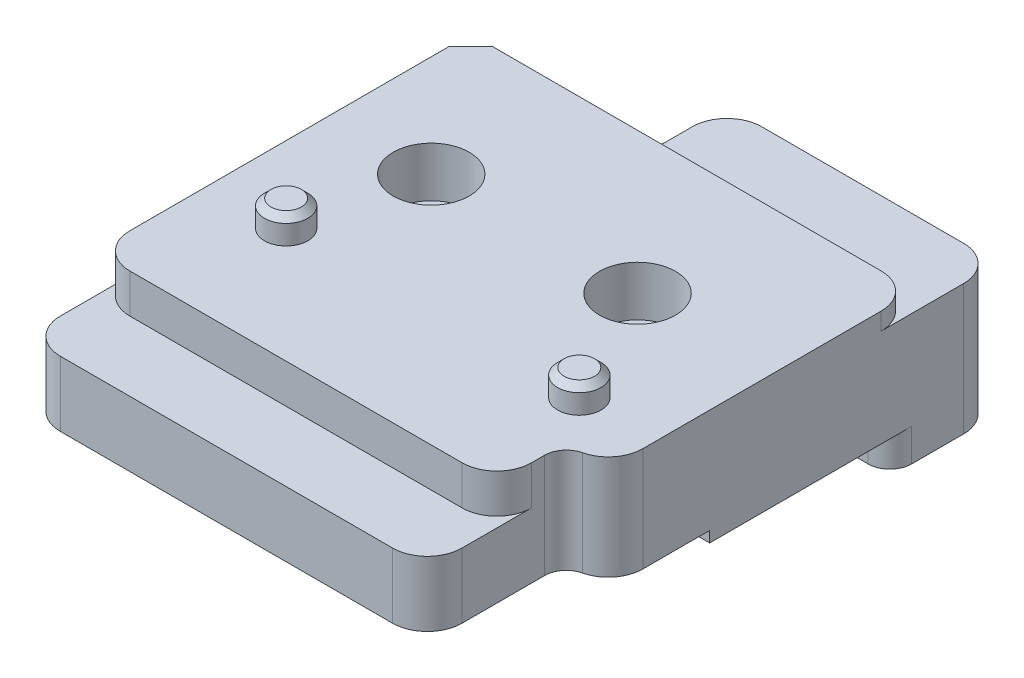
from build123d import *

# Parameters (mm, degrees)
EXTRUDE_1_DEPTH           = 2.5
SKETCH_3_R                = 1.15
CUT_EXTRUDE_2_DEPTH       = 15.758472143
SKETCH_4_W                = 25.5
SKETCH_4_H                = 2.5
EXTRUDE_2_DEPTH           = 16.7
SKETCH_5_W                = 1
SKETCH_5_H                = 2.5
EXTRUDE_3_DEPTH           = 21.7
SKETCH_6_W                = 1.3
SKETCH_6_H                = 4.290475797
CUT_EXTRUDE_3_DEPTH       = 24.747684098
SKETCH_7_R                = 1.15
EXTRUDE_4_DEPTH           = 2.1
SKETCH_11_W               = 27.5
SKETCH_11_H               = 11
CUT_EXTRUDE_6_DEPTH       = 2
SKETCH_13_W               = 5
SKETCH_13_H               = 4.5
CUT_EXTRUDE_8_DEPTH       = 2
FILLET_2_R                = 2
FILLET_3_R                = 1
SKETCH_15_R               = 1.15
CUT_EXTRUDE_9_DEPTH       = 24.75841956
CUT_EXTRUDE_10_DEPTH      = 1
CUT_EXTRUDE_11_DEPTH      = 24.75841956
CUT_EXTRUDE_12_DEPTH      = 1
SKETCH_19_W               = 5
SKETCH_19_H               = 21.7
CUT_EXTRUDE_13_DEPTH      = 25.059561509
CUT_EXTRUDE_18_DEPTH      = 24.75841956
SKETCH_25_W               = 22.5
SKETCH_25_H               = 2
CUT_EXTRUDE_19_DEPTH      = 1.5
CUT_EXTRUDE_22_DEPTH      = 2
SKETCH_32_W               = 20.5
SKETCH_32_H               = 3.1
EXTRUDE_6_DEPTH           = 10.9
SKETCH_34_W               = 2
SKETCH_34_H               = 6.5
CUT_EXTRUDE_23_DEPTH      = 24.737786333
SKETCH_17_R               = 1
EXTRUDE_8_DEPTH           = 1.5
EXTRUDE_9_DEPTH           = 0.5
CHAMFER_3_SIZE            = 0.3
SKETCH_42_W               = 12.5
SKETCH_42_H               = 3.3
EXTRUDE_10_DEPTH          = 3.6
SKETCH_43_W               = 12.5
SKETCH_43_H               = 5.5
EXTRUDE_11_DEPTH          = 3.4
SKETCH_44_R               = 3.5
CUT_EXTRUDE_29_DEPTH      = 25.548574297
CUT_EXTRUDE_30_DEPTH      = 3.4
SKETCH_46_W               = 12.85200241
SKETCH_46_H               = 4.596360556
CUT_EXTRUDE_32_DEPTH      = 1
EXTRUDE_12_DEPTH          = 1.9
CUT_EXTRUDE_34_DEPTH      = 1
EXTRUDE_13_DEPTH          = 0.4
CUT_EXTRUDE_35_DEPTH      = 1
CUT_EXTRUDE_START         = -2
CUT_EXTRUDE_36_DEPTH      = 2
FILLET_11_R               = 0.75
SKETCH_55_W               = 18.5
SKETCH_55_H               = 5.5
CUT_EXTRUDE_39_DEPTH      = 0.1
FILLET_8_R                = 1
HOLE_WIZARD_0_D           = 2.2
HOLE_WIZARD_0_DEPTH       = 6
HOLE_WIZARD_0_CBORE_D     = 4
HOLE_WIZARD_0_CBORE_DEPTH = 2.3
HOLE_WIZARD_0_TIP         = 0.660946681
SKETCH_58_R               = 1.75
CUT_EXTRUDE_40_DEPTH      = 2.5
CUT_EXTRUDE_START_2       = -0.2
SKETCH_59_R               = 1
CUT_EXTRUDE_41_DEPTH      = 0.2
CUT_EXTRUDE_START_3       = -0.5
CUT_EXTRUDE_42_DEPTH      = 0.5
FILLET_10_R               = 1
SKETCH_61_W               = 20.725680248
SKETCH_61_H               = 11.032527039
CUT_EXTRUDE_43_DEPTH      = 1
EXTRUDE_14_DEPTH          = 0.5
EXTRUDE_15_DEPTH          = 2
SKETCH_65_W               = 18.5
SKETCH_65_H               = 3.997127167
CUT_EXTRUDE_45_DEPTH      = 1.8
FILLET_13_R               = 1.6
CHAMFER_4_SIZE            = 1


with BuildPart() as part:
    # Sketch 1 → Extrude 1 (new body)
    with BuildSketch(Plane(origin=(0, 0, 0), x_dir=(1, 0, 0), z_dir=(0, 1, 0))):
        Polygon((-12.75, 2.5), (-2.5, 2.5), (-2.5, 7), (2.5, 7), (2.5, 2.5), (12.75, 2.5), (12.75, -2.5), (-12.75, -2.5), align=None)
    extrude(amount=EXTRUDE_1_DEPTH)

    # Sketch 3 → Cut-Extrude 2 (cut, through all)
    with BuildSketch(Plane.XZ):
        with Locations(Location((0, -5, 0), (0, 0, 270))):
            Circle(SKETCH_3_R)
    extrude(amount=-CUT_EXTRUDE_2_DEPTH, mode=Mode.SUBTRACT)

    # Sketch 4 → Extrude 2 (add)
    with BuildSketch(Plane.XY.offset(2.5)):
        with Locations((0, 1.25)):
            Rectangle(SKETCH_4_W, SKETCH_4_H)
    extrude(amount=EXTRUDE_2_DEPTH)

    # Sketch 5 → Extrude 3 (add)
    with BuildSketch(Plane(origin=(0, 0, -2.5), x_dir=(-1, 0, 0), z_dir=(0, 0, -1))):
        with Locations((13.25, 1.25)):
            Rectangle(SKETCH_5_W, SKETCH_5_H)
        with Locations((-13.25, 1.25)):
            Rectangle(SKETCH_5_W, SKETCH_5_H)
    extrude(amount=-EXTRUDE_3_DEPTH)

    # Sketch 6 → Cut-Extrude 3 (cut, through all)
    with BuildSketch(Plane.XZ):
        with Locations((-13.1, -0.354762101)):
            Rectangle(SKETCH_6_W, SKETCH_6_H)
    extrude(amount=-CUT_EXTRUDE_3_DEPTH, mode=Mode.SUBTRACT)

    # Sketch 7 → Extrude 4 (add)
    with BuildSketch(Plane(origin=(0, 2.5, 0), x_dir=(1, 0, 0), z_dir=(0, 1, 0))):
        Polygon((13.75, 2.5), (2.5, 2.5), (2.5, 7), (-2.5, 7), (-2.5, 2.5), (-12.45, 2.5), (-12.45, -1.790475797), (-13.75, -1.790475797), (-13.75, -19.2), (13.75, -19.2), align=None)
        with Locations(Location((0, 5, 0), (0, 0, 90))):
            Circle(SKETCH_7_R, mode=Mode.SUBTRACT)
    extrude(amount=EXTRUDE_4_DEPTH)

    # Sketch 11 → Cut-Extrude 6 (cut)
    with BuildSketch(Plane(origin=(0, 0, 0), x_dir=(-1, 0, 0), z_dir=(0, -1, 0))):
        with Locations((0, -13.7)):
            Rectangle(SKETCH_11_W, SKETCH_11_H)
    extrude(amount=-CUT_EXTRUDE_6_DEPTH, mode=Mode.SUBTRACT)

    # Sketch 13 → Cut-Extrude 8 (cut)
    with BuildSketch(Plane.XZ):
        with Locations((0, -4.75)):
            Rectangle(SKETCH_13_W, SKETCH_13_H)
    extrude(amount=-CUT_EXTRUDE_8_DEPTH, mode=Mode.SUBTRACT)

    # Fillet 2
    fillet_2_edges = [part.edges().sort_by_distance(p)[0] for p in [
        (-2.5, 3.3, -2.5),
        (-2.5, 3.3, -7),
        (2.5, 3.3, -7),
        (2.5, 3.3, -2.5),
    ]]
    fillet(fillet_2_edges, radius=FILLET_2_R)

    # Fillet 3
    fillet_3_edges = [part.edges().sort_by_distance(p)[0] for p in [
        (13.75, 3.3, 19.2),
    ]]
    fillet(fillet_3_edges, radius=FILLET_3_R)

    # Sketch 15 → Cut-Extrude 9 (cut, through all)
    with BuildSketch(Plane.XZ.offset(-2)):
        with Locations(Location((11.05, 16.5, 0), (0, 0, 270))):
            Circle(SKETCH_15_R)
    extrude(amount=-CUT_EXTRUDE_9_DEPTH, mode=Mode.SUBTRACT)

    # Sketch 16 → Cut-Extrude 10 (cut)
    with BuildSketch(Plane(origin=(0, 4.6, 0), x_dir=(1, 0, 0), z_dir=(0, 1, 0))):
        with BuildLine():
            Line((-5, -17.7), (5, -17.7))
            ThreePointArc((5, -17.7), (6.5, -19.2), (5, -20.7))
            Line((5, -20.7), (-5, -20.7))
            ThreePointArc((-5, -20.7), (-6.5, -19.2), (-5, -17.7))
        make_face()
    extrude(amount=-CUT_EXTRUDE_10_DEPTH, mode=Mode.SUBTRACT)

    # Sketch 18 → Cut-Extrude 11 (cut, through all)
    with BuildSketch(Plane.XZ.offset(-2)):
        with BuildLine():
            Line((-2.5, -4.5), (-2.5, -5))
            ThreePointArc((-2.5, -5), (-1.914213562, -6.414213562), (-0.5, -7))
            Line((-0.5, -7), (0.5, -7))
            ThreePointArc((0.5, -7), (1.914213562, -6.414213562), (2.5, -5))
            Line((2.5, -5), (2.5, -4.5))
            ThreePointArc((2.5, -4.5), (3.085786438, -3.085786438), (4.5, -2.5))
            Line((4.5, -2.5), (-4.5, -2.5))
            ThreePointArc((-4.5, -2.5), (-3.085786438, -3.085786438), (-2.5, -4.5))
        make_face()
    extrude(amount=-CUT_EXTRUDE_11_DEPTH, mode=Mode.SUBTRACT)

    # Sketch 12 → Cut-Extrude 12 (cut)
    with BuildSketch(Plane.XZ.offset(-2)):
        with BuildLine():
            Line((2.643454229, 10.204733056), (-5.98291891, 18.83143851))
            ThreePointArc((-5.98291891, 18.83143851), (-6.336479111, 18.97789193), (-6.690039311, 18.83143851))
            Line((-6.690039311, 18.83143851), (-7.60924544, 17.912196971))
            ThreePointArc((-7.60924544, 17.912196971), (-7.75568524, 17.55865039), (-7.60924544, 17.205103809))
            Line((-7.60924544, 17.205103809), (1.0171277, 8.578398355))
            ThreePointArc((1.0171277, 8.578398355), (1.3706879, 8.431944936), (1.7242481, 8.578398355))
            Line((1.7242481, 8.578398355), (2.643454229, 9.497639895))
            ThreePointArc((2.643454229, 9.497639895), (2.789894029, 9.851186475), (2.643454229, 10.204733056))
        make_face()
        with BuildLine():
            Line((12.473454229, 10.204733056), (3.84708109, 18.83143851))
            ThreePointArc((3.84708109, 18.83143851), (3.493520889, 18.97789193), (3.139960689, 18.83143851))
            Line((3.139960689, 18.83143851), (2.22075456, 17.912196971))
            ThreePointArc((2.22075456, 17.912196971), (2.07431476, 17.55865039), (2.22075456, 17.205103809))
            Line((2.22075456, 17.205103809), (10.8471277, 8.578398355))
            ThreePointArc((10.8471277, 8.578398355), (11.2006879, 8.431944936), (11.5542481, 8.578398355))
            Line((11.5542481, 8.578398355), (12.473454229, 9.497639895))
            ThreePointArc((12.473454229, 9.497639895), (12.619894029, 9.851186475), (12.473454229, 10.204733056))
        make_face()
    extrude(amount=-CUT_EXTRUDE_12_DEPTH, mode=Mode.SUBTRACT)

    # Sketch 19 → Cut-Extrude 13 (cut, through all)
    with BuildSketch(Plane.XZ):
        with Locations((-11.25, 8.35)):
            Rectangle(SKETCH_19_W, SKETCH_19_H)
    extrude(amount=-CUT_EXTRUDE_13_DEPTH, mode=Mode.SUBTRACT)

    # Sketch 24 → Cut-Extrude 18 (cut, through all)
    with BuildSketch(Plane.XZ.offset(-2)):
        with BuildLine():
            Line((12.75, 19.2), (-8.75, 19.2))
            Line((-8.75, 19.2), (-8.75, 8.2))
            Line((-8.75, 8.2), (13.75, 8.2))
            Line((13.75, 8.2), (13.75, 18.2))
            ThreePointArc((13.75, 18.2), (13.457106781, 18.907106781), (12.75, 19.2))
        make_face()
    extrude(amount=-CUT_EXTRUDE_18_DEPTH, mode=Mode.SUBTRACT)

    # Sketch 25 → Cut-Extrude 19 (cut)
    with BuildSketch(Plane.XZ):
        with Locations((2.5, 7.2)):
            Rectangle(SKETCH_25_W, SKETCH_25_H)
    extrude(amount=-CUT_EXTRUDE_19_DEPTH, mode=Mode.SUBTRACT)

    # Sketch 31 → Cut-Extrude 22 (cut)
    with BuildSketch(Plane.ZY.offset(8.75)):
        Polygon((-2.5, 0), (6.2, 0), (6.2, 1.5), (8.2, 1.5), (8.2, 4.6), (-2.5, 4.6), align=None)
    extrude(amount=-CUT_EXTRUDE_22_DEPTH, mode=Mode.SUBTRACT)

    # Sketch 32 → Extrude 6 (add)
    with BuildSketch(Plane.XY.offset(8.2)):
        with Locations((3.5, 3.05)):
            Rectangle(SKETCH_32_W, SKETCH_32_H)
    extrude(amount=EXTRUDE_6_DEPTH)

    # Sketch 34 → Cut-Extrude 23 (cut, through all)
    with BuildSketch(Plane.XZ.offset(-1.5)):
        with Locations((12.75, 15.85)):
            Rectangle(SKETCH_34_W, SKETCH_34_H)
    extrude(amount=-CUT_EXTRUDE_23_DEPTH, mode=Mode.SUBTRACT)

    # Sketch 17 → Extrude 8 (add)
    with BuildSketch(Plane(origin=(0, 4.6, 0), x_dir=(1, 0, 0), z_dir=(0, 1, 0))):
        with Locations(Location((10.25, -10.5, 0), (0, 0, 270))):
            Circle(SKETCH_17_R)
        with Locations(Location((-3.25, -10.5, 0), (0, 0, 270))):
            Circle(SKETCH_17_R)
    extrude(amount=EXTRUDE_8_DEPTH)

    # Sketch 39 → Extrude 9 (add)
    with BuildSketch(Plane(origin=(0, 4.6, 0), x_dir=(1, 0, 0), z_dir=(0, 1, 0))):
        Polygon((-6.75, -19.1), (11.75, -19.1), (11.75, -12.6), (13.75, -12.6), (13.75, 2.5), (-6.75, 2.5), align=None)
    extrude(amount=EXTRUDE_9_DEPTH)

    # Chamfer 3
    chamfer_3_edges = [part.edges().sort_by_distance(p)[0] for p in [
        (10.25, 6.1, 9.5),
        (-3.25, 6.1, 9.5),
    ]]
    chamfer(chamfer_3_edges, length=CHAMFER_3_SIZE)

    # Sketch 42 → Extrude 10 (add)
    with BuildSketch(Plane(origin=(0, 5.1, 0), x_dir=(1, 0, 0), z_dir=(0, 1, 0))):
        with Locations((7.5, 4.15)):
            Rectangle(SKETCH_42_W, SKETCH_42_H)
    extrude(amount=-EXTRUDE_10_DEPTH)

    # Sketch 43 → Extrude 11 (add)
    with BuildSketch(Plane.XZ.offset(-1.5)):
        with Locations((7.5, -3.05)):
            Rectangle(SKETCH_43_W, SKETCH_43_H)
    extrude(amount=EXTRUDE_11_DEPTH)

    # Sketch 44 → Cut-Extrude 29 (cut, through all)
    with BuildSketch(Plane.XY.offset(-0.3)):
        with Locations((6.845847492, -2.4)):
            Circle(SKETCH_44_R)
    extrude(amount=-CUT_EXTRUDE_29_DEPTH, mode=Mode.SUBTRACT)

    # Sketch 45 → Cut-Extrude 30 (cut)
    with BuildSketch(Plane.XZ.offset(1.9)):
        with BuildLine():
            Line((6.345847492, -4.05), (6.345847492, -1.05))
            ThreePointArc((6.345847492, -1.05), (6.845847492, -0.55), (7.345847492, -1.05))
            Line((7.345847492, -1.05), (7.345847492, -4.05))
            ThreePointArc((7.345847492, -4.05), (6.845847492, -4.55), (6.345847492, -4.05))
        make_face()
    extrude(amount=-CUT_EXTRUDE_30_DEPTH, mode=Mode.SUBTRACT)

    # Sketch 46 → Cut-Extrude 32 (cut)
    with BuildSketch(Plane(origin=(0, 5.1, 0), x_dir=(1, 0, 0), z_dir=(0, 1, 0))):
        with Locations((7.672490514, 4.798180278)):
            Rectangle(SKETCH_46_W, SKETCH_46_H)
    extrude(amount=-CUT_EXTRUDE_32_DEPTH, mode=Mode.SUBTRACT)

    # Sketch 47 → Extrude 12 (add)
    with BuildSketch(Plane.XZ.offset(-1.5)):
        Polygon((13.75, 6.2), (13.75, 12.6), (11.75, 12.6), (11.75, 19.1), (-6.75, 19.1), (-6.75, 6.2), align=None)
    extrude(amount=EXTRUDE_12_DEPTH)

    # Sketch 49 → Cut-Extrude 34 (cut)
    with BuildSketch(Plane(origin=(0, -0.4, 0), x_dir=(-1, 0, 0), z_dir=(0, -1, 0))):
        with BuildLine():
            Line((-10.388808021, -9.009182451), (-12.64114543, -11.26151986))
            Line((-12.64114543, -11.26151986), (-5.252418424, -18.650246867))
            ThreePointArc((-5.252418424, -18.650246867), (-4.722088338, -18.869916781), (-4.191758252, -18.650246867))
            Line((-4.191758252, -18.650246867), (-2.469750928, -16.928239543))
            Line((-2.469750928, -16.928239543), (-10.388808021, -9.009182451))
        make_face()
        Polygon((-1.221065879, -8.303424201), (-2.850269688, -9.93262801), (5.078774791, -17.861672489), (6.7079786, -16.23246868), align=None)
    extrude(amount=-CUT_EXTRUDE_34_DEPTH, mode=Mode.SUBTRACT)

    # Sketch 50 → Extrude 13 (add)
    with BuildSketch(Plane.XZ):
        Polygon((9.393395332, -0.3), (13.75, -0.3), (13.75, 6.2), (-6.75, 6.2), (-6.75, -2.5), (1.25, -2.5), (1.25, -0.3), (4.298299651, -0.3), align=None)
    extrude(amount=EXTRUDE_13_DEPTH)

    # Sketch 51 → Cut-Extrude 35 (cut)
    with BuildSketch(Plane(origin=(0, 0, -2.5), x_dir=(-1, 0, 0), z_dir=(0, 0, -1))):
        Polygon((6.75, -0.4), (6.75, 5.1), (-13.75, 5.1), (-13.75, 4.1), (-1.25, 4.1), (-1.25, -0.4), align=None)
    extrude(amount=-CUT_EXTRUDE_35_DEPTH, mode=Mode.SUBTRACT)

    # Sketch 52 → Cut-Extrude 36 (cut)
    with BuildSketch(Plane(origin=(0, 0, -0.3), x_dir=(-1, 0, 0), z_dir=(0, 0, -1)).offset(CUT_EXTRUDE_START)):
        with BuildLine():
            Line((-9.718128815, -0.4), (-3.973566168, -0.4))
            ThreePointArc((-3.973566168, -0.4), (-6.845847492, 1.1), (-9.718128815, -0.4))
        make_face()
    extrude(amount=CUT_EXTRUDE_36_DEPTH, mode=Mode.SUBTRACT)

    # Fillet 11
    fillet_11_edges = [part.edges().sort_by_distance(p)[0] for p in [
        (10.388808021, 0.1, 9.009182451),
        (2.469750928, 0.1, 16.928239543),
        (12.64114543, 0.1, 11.26151986),
        (1.221065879, 0.1, 8.303424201),
        (-6.7079786, 0.1, 16.23246868),
        (-5.078774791, 0.1, 17.861672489),
        (2.850269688, 0.1, 9.93262801),
    ]]
    fillet(fillet_11_edges, radius=FILLET_11_R)

    # Sketch 55 → Cut-Extrude 39 (cut)
    with BuildSketch(Plane.XY.offset(19.1)):
        with Locations((2.5, 2.35)):
            Rectangle(SKETCH_55_W, SKETCH_55_H)
    extrude(amount=-CUT_EXTRUDE_39_DEPTH, mode=Mode.SUBTRACT)

    # Fillet 8
    fillet_8_edges = [part.edges().sort_by_distance(p)[0] for p in [
        (11.75, 2.35, 12.6),
        (1.25, 1.85, -1.5),
    ]]
    fillet(fillet_8_edges, radius=FILLET_8_R)

    # Hole Wizard 0
    with Locations(Plane(origin=(0, -0.4, 0), x_dir=(-1, 0, 0), z_dir=(0, -1, 0))):
        with Locations((2.07, -4.999804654), (-7.43, -4.999804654)):
            CounterBoreHole(HOLE_WIZARD_0_D / 2, HOLE_WIZARD_0_CBORE_D / 2, HOLE_WIZARD_0_CBORE_DEPTH, depth=HOLE_WIZARD_0_DEPTH)
            with Locations((0, 0, -(HOLE_WIZARD_0_DEPTH + HOLE_WIZARD_0_TIP / 2))):  # 118° drill point
                Cone(0, HOLE_WIZARD_0_D / 2, HOLE_WIZARD_0_TIP, mode=Mode.SUBTRACT)

    # Sketch 58 → Cut-Extrude 40 (cut)
    with BuildSketch(Plane(origin=(0, 5.1, 0), x_dir=(1, 0, 0), z_dir=(0, 1, 0))):
        with Locations(Location((7.43, -4.999804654, 0), (0, 0, 270))):
            Circle(SKETCH_58_R)
        with Locations(Location((-2.07, -4.999804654, 0), (0, 0, 270))):
            Circle(SKETCH_58_R)
    extrude(amount=-CUT_EXTRUDE_40_DEPTH, mode=Mode.SUBTRACT)

    # Sketch 59 → Cut-Extrude 41 (cut)
    with BuildSketch(Plane(origin=(0, 5.1, 0), x_dir=(1, 0, 0), z_dir=(0, 1, 0)).offset(CUT_EXTRUDE_START_2)):
        with BuildLine():
            Line((-6.75, 1.5), (-6.75, -19))
            Line((-6.75, -19), (11.75, -19))
            Line((11.75, -19), (11.75, -13.6))
            ThreePointArc((11.75, -13.6), (12.042893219, -12.892893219), (12.75, -12.6))
            Line((12.75, -12.6), (13.75, -12.6))
            Line((13.75, -12.6), (13.75, 1.5))
            Line((13.75, 1.5), (-6.75, 1.5))
        make_face()
        with Locations(Location((-3.25, -10.5, 0), (0, 0, 270))):
            Circle(SKETCH_59_R, mode=Mode.SUBTRACT)
        with Locations(Location((10.25, -10.5, 0), (0, 0, 270))):
            Circle(SKETCH_59_R, mode=Mode.SUBTRACT)
    extrude(amount=CUT_EXTRUDE_41_DEPTH, mode=Mode.SUBTRACT)

    # Sketch 60 → Cut-Extrude 42 (cut)
    with BuildSketch(Plane(origin=(0, 0, -5.8), x_dir=(-1, 0, 0), z_dir=(0, 0, -1)).offset(CUT_EXTRUDE_START_3)):
        with BuildLine():
            Line((-1.25, 4.1), (-13.75, 4.1))
            Line((-13.75, 4.1), (-13.75, -1.9))
            Line((-13.75, -1.9), (-10.309949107, -1.9))
            ThreePointArc((-10.309949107, -1.9), (-6.845847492, 1.1), (-3.381745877, -1.9))
            Line((-3.381745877, -1.9), (-1.25, -1.9))
            Line((-1.25, -1.9), (-1.25, 4.1))
        make_face()
    extrude(amount=CUT_EXTRUDE_42_DEPTH, mode=Mode.SUBTRACT)

    # Fillet 10
    fillet_10_edges = [part.edges().sort_by_distance(p)[0] for p in [
        (13.75, -1.15, -0.3),
        (1.25, -1.15, -0.3),
    ]]
    fillet(fillet_10_edges, radius=FILLET_10_R)

    # Sketch 61 → Cut-Extrude 43 (cut)
    with BuildSketch(Plane.XZ.offset(0.4)):
        with Locations((3.387159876, 13.51626352)):
            Rectangle(SKETCH_61_W, SKETCH_61_H)
    extrude(amount=-CUT_EXTRUDE_43_DEPTH, mode=Mode.SUBTRACT)

    # Sketch 62 → Extrude 14 (add)
    with BuildSketch(Plane.XZ.offset(-0.6)):
        with BuildLine():
            Line((11.75, 13.6), (11.75, 19))
            Line((11.75, 19), (-6.75, 19))
            Line((-6.75, 19), (-6.75, 8))
            Line((-6.75, 8), (13.75, 8))
            Line((13.75, 8), (13.75, 12.6))
            Line((13.75, 12.6), (12.75, 12.6))
            ThreePointArc((12.75, 12.6), (12.042893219, 12.892893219), (11.75, 13.6))
        make_face()
    extrude(amount=EXTRUDE_14_DEPTH)

    # Sketch 64 → Extrude 15 (add)
    with BuildSketch(Plane(origin=(0, 0, 1.7), x_dir=(-1, 0, 0), z_dir=(0, 0, -1))):
        with BuildLine():
            Line((-9.718128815, -0.4), (-3.973566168, -0.4))
            ThreePointArc((-3.973566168, -0.4), (-6.845847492, 1.1), (-9.718128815, -0.4))
        make_face()
    extrude(amount=EXTRUDE_15_DEPTH)

    # Sketch 65 → Cut-Extrude 45 (cut)
    with BuildSketch(Plane(origin=(0, 4.9, 0), x_dir=(1, 0, 0), z_dir=(0, 1, 0))):
        with Locations((2.5, -17.798563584)):
            Rectangle(SKETCH_65_W, SKETCH_65_H)
    extrude(amount=-CUT_EXTRUDE_45_DEPTH, mode=Mode.SUBTRACT)

    # Fillet 13
    fillet_13_edges = [part.edges().sort_by_distance(p)[0] for p in [
        (13.75, 1.1, -5.3),
        (1.25, 1.1, -5.3),
        (-6.75, 1.6, 19),
        (11.75, 1.6, 19),
        (13.75, 2.5, 12.6),
        (11.75, 4, 15.8),
        (-6.75, 4, 15.8),
        (13.75, 4.5, -1.5),
    ]]
    fillet(fillet_13_edges, radius=FILLET_13_R)

    # Chamfer 4
    chamfer_4_edges = [part.edges().sort_by_distance(p)[0] for p in [
        (-6.75, 2.25, -1.5),
    ]]
    chamfer(chamfer_4_edges, length=CHAMFER_4_SIZE)


solid = part.part
